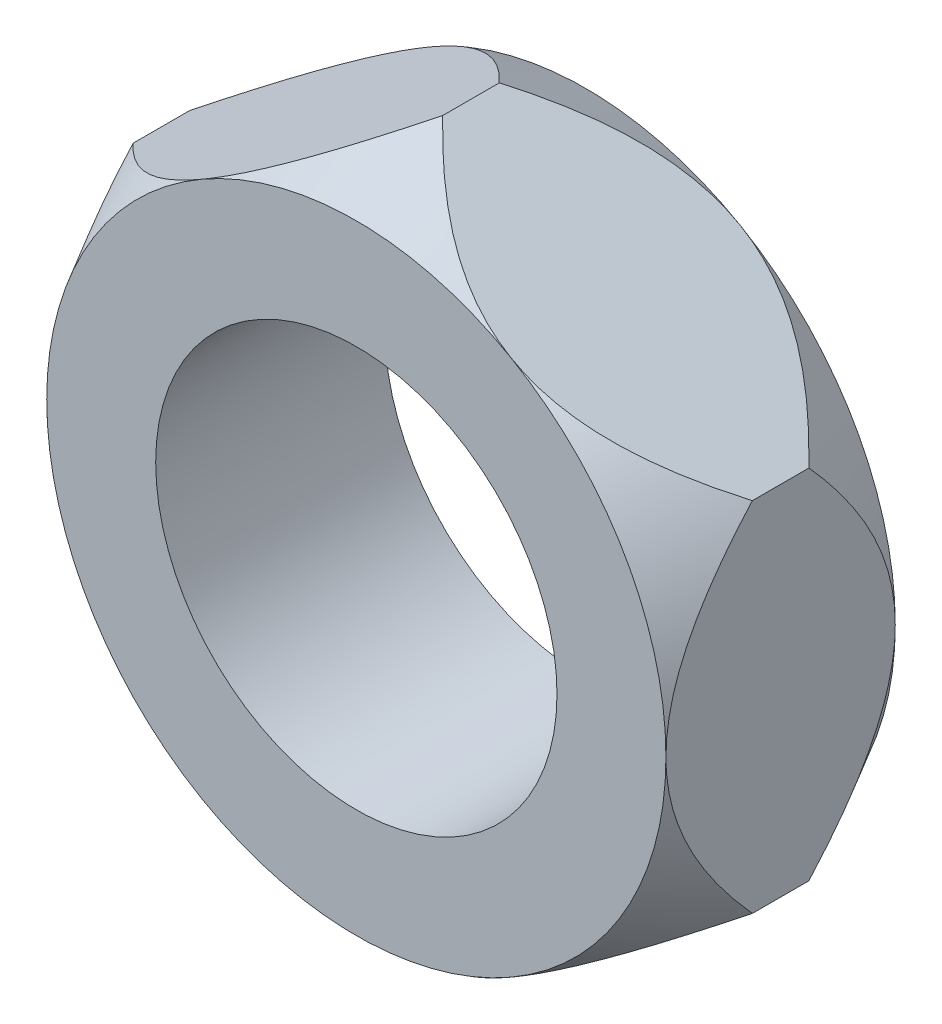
from build123d import *

# Parameters (mm, degrees)
BOSS_EXTRUDE1_DEPTH     = 2
SKETCH2_OUTSIDE_W       = 15.288
SKETCH2_OUTSIDE_H       = 16.124
SKETCH2_OUTSIDE_R       = 2.7
CUT_EXTRUDE1_DEPTH      = 5.583666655
CUT_EXTRUDE1_DRAFT      = -29
MIRROR1_COPY_1_SKETCH_W = 15.288
MIRROR1_COPY_1_SKETCH_H = 16.124
MIRROR1_COPY_1_SKETCH_R = 2.7
MIRROR1_COPY_1_DEPTH    = 5.583666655
MIRROR1_COPY_1_DRAFT    = -29
SKETCH3_R               = 1.75
CUT_EXTRUDE2_DEPTH      = 2


with BuildPart() as part:
    # Sketch1 → Boss-Extrude1 (new body)
    with BuildSketch(Plane.XY):
        Polygon((0, 3.117691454), (-2.7, 1.558845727), (-2.7, -1.558845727), (0, -3.117691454), (2.7, -1.558845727), (2.7, 1.558845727), align=None)
    extrude(amount=BOSS_EXTRUDE1_DEPTH)


with BuildPart() as cut_extrude1_tool:
    # Sketch2 outside → Cut-Extrude1 (with draft: the straight prism first)
    with BuildSketch(Plane.XY.offset(2)):
        Rectangle(SKETCH2_OUTSIDE_W, SKETCH2_OUTSIDE_H)
        Circle(SKETCH2_OUTSIDE_R, mode=Mode.SUBTRACT)
    extrude(amount=-CUT_EXTRUDE1_DEPTH)
    # Cut-Extrude1: the draft: its side faces are tilted about the plane it starts from
    cut_extrude1_sides = [cut_extrude1_tool.faces().sort_by_distance(p)[0] for p in [
        (0, -8.062, -0.791833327),
        (7.644, 0, -0.791833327),
        (0, 8.062, -0.791833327),
        (-7.644, 0, -0.791833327),
        (-2.7, 0, -0.791833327),
    ]]
    draft(cut_extrude1_sides, Plane.XY.offset(2), CUT_EXTRUDE1_DRAFT)


with BuildPart() as part_1:
    add(part.part)

    # Cut-Extrude1: cut by cut_extrude1_tool
    add(cut_extrude1_tool.part, mode=Mode.SUBTRACT)


with BuildPart() as mirror1_copy_1_tool:
    # Mirror1 copy 1 sketch → Mirror1 copy 1 (with draft: the straight prism first)
    with BuildSketch(Plane(origin=(0, 0, 0), x_dir=(1, 0, 0), z_dir=(0, 0, -1))):
        Rectangle(MIRROR1_COPY_1_SKETCH_W, MIRROR1_COPY_1_SKETCH_H)
        Circle(MIRROR1_COPY_1_SKETCH_R, mode=Mode.SUBTRACT)
    extrude(amount=-MIRROR1_COPY_1_DEPTH)
    # Mirror1 copy 1: the draft: its side faces are tilted about the plane it starts from
    mirror1_copy_1_sides = [mirror1_copy_1_tool.faces().sort_by_distance(p)[0] for p in [
        (0, -8.062, 2.791833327),
        (7.644, 0, 2.791833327),
        (0, 8.062, 2.791833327),
        (-7.644, 0, 2.791833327),
        (-2.7, 0, 2.791833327),
    ]]
    draft(mirror1_copy_1_sides, Plane(origin=(0, 0, 0), x_dir=(1, 0, 0), z_dir=(0, 0, -1)), MIRROR1_COPY_1_DRAFT)


with BuildPart() as part_2:
    add(part_1.part)

    # Mirror1 copy 1: cut by mirror1_copy_1_tool
    add(mirror1_copy_1_tool.part, mode=Mode.SUBTRACT)

    # Sketch3 → Cut-Extrude2 (cut)
    with BuildSketch(Plane.XY.offset(2)):
        Circle(SKETCH3_R)
    extrude(amount=-CUT_EXTRUDE2_DEPTH, mode=Mode.SUBTRACT)


solid = part_2.part
